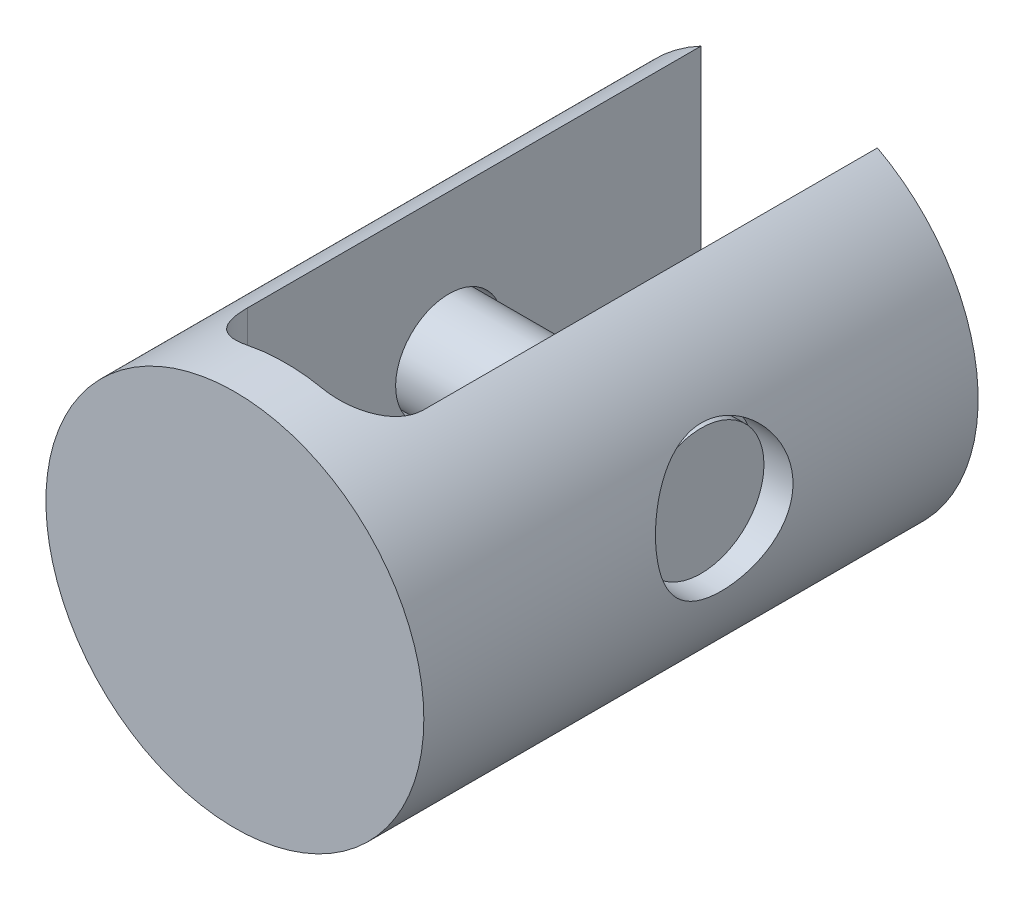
ISO-10303-21;
HEADER;
FILE_DESCRIPTION(('STEP AP214'),'2;1');
FILE_NAME('part.step','',(''),(''),'','','');
FILE_SCHEMA(('AUTOMOTIVE_DESIGN { 1 0 10303 214 1 1 1 1 }'));
ENDSEC;
DATA;
#1=APPLICATION_CONTEXT('core data for automotive mechanical design processes');
#2=APPLICATION_PROTOCOL_DEFINITION('international standard','automotive_design',2000,#1);
#3=PRODUCT_CONTEXT('',#1,'mechanical');
#4=PRODUCT('Part','Part','',(#3));
#5=PRODUCT_RELATED_PRODUCT_CATEGORY('part','',(#4));
#6=PRODUCT_DEFINITION_FORMATION('','',#4);
#7=PRODUCT_DEFINITION_CONTEXT('part definition',#1,'design');
#8=PRODUCT_DEFINITION('design','',#6,#7);
#9=PRODUCT_DEFINITION_SHAPE('','',#8);
#10=(LENGTH_UNIT() NAMED_UNIT(*) SI_UNIT(.MILLI.,.METRE.));
#11=(NAMED_UNIT(*) PLANE_ANGLE_UNIT() SI_UNIT($,.RADIAN.));
#12=(NAMED_UNIT(*) SI_UNIT($,.STERADIAN.) SOLID_ANGLE_UNIT());
#13=UNCERTAINTY_MEASURE_WITH_UNIT(LENGTH_MEASURE(1.E-05),#10,'distance_accuracy_value','');
#14=(GEOMETRIC_REPRESENTATION_CONTEXT(3) GLOBAL_UNCERTAINTY_ASSIGNED_CONTEXT((#13)) GLOBAL_UNIT_ASSIGNED_CONTEXT((#10,
#11,#12)) REPRESENTATION_CONTEXT('',''));
#15=CARTESIAN_POINT('',(0.,0.,0.));
#16=DIRECTION('',(0.,0.,1.));
#17=DIRECTION('',(1.,0.,0.));
#18=AXIS2_PLACEMENT_3D('',#15,#16,#17);
#19=CARTESIAN_POINT('',(19.05,3.175,0.));
#20=DIRECTION('',(-1.,0.,0.));
#21=DIRECTION('',(0.,0.,1.));
#22=AXIS2_PLACEMENT_3D('',#19,#20,#21);
#23=CYLINDRICAL_SURFACE('',#22,6.35);
#24=CARTESIAN_POINT('',(19.05,3.175,0.));
#25=DIRECTION('',(1.,0.,0.));
#26=DIRECTION('',(0.,0.,-1.));
#27=AXIS2_PLACEMENT_3D('',#24,#25,#26);
#28=CIRCLE('',#27,6.35);
#29=CARTESIAN_POINT('',(19.05,3.175,6.35));
#30=VERTEX_POINT('',#29);
#31=EDGE_CURVE('E11',#30,#30,#28,.T.);
#32=CARTESIAN_POINT('',(-19.05,3.175,0.));
#33=DIRECTION('',(1.,0.,0.));
#34=DIRECTION('',(0.,0.,-1.));
#35=AXIS2_PLACEMENT_3D('',#32,#33,#34);
#36=CIRCLE('',#35,6.35);
#37=CARTESIAN_POINT('',(-19.05,3.175,6.35));
#38=VERTEX_POINT('',#37);
#39=EDGE_CURVE('E55',#38,#38,#36,.T.);
#40=CARTESIAN_POINT('',(19.05,3.175,6.35));
#41=CARTESIAN_POINT('',(18.653125,3.175,6.35));
#42=CARTESIAN_POINT('',(18.25625,3.175,6.35));
#43=CARTESIAN_POINT('',(17.4625,3.175,6.35));
#44=CARTESIAN_POINT('',(17.065625,3.175,6.35));
#45=CARTESIAN_POINT('',(16.271875,3.175,6.35));
#46=CARTESIAN_POINT('',(15.875,3.175,6.35));
#47=CARTESIAN_POINT('',(15.08125,3.175,6.35));
#48=CARTESIAN_POINT('',(14.684375,3.175,6.35));
#49=CARTESIAN_POINT('',(13.890625,3.175,6.35));
#50=CARTESIAN_POINT('',(13.49375,3.175,6.35));
#51=CARTESIAN_POINT('',(12.7,3.175,6.35));
#52=CARTESIAN_POINT('',(12.303125,3.175,6.35));
#53=CARTESIAN_POINT('',(11.509375,3.175,6.35));
#54=CARTESIAN_POINT('',(11.1125,3.175,6.35));
#55=CARTESIAN_POINT('',(10.31875,3.175,6.35));
#56=CARTESIAN_POINT('',(9.921875,3.175,6.35));
#57=CARTESIAN_POINT('',(9.128125,3.175,6.35));
#58=CARTESIAN_POINT('',(8.73125,3.175,6.35));
#59=CARTESIAN_POINT('',(7.9375,3.175,6.35));
#60=CARTESIAN_POINT('',(7.540625,3.175,6.35));
#61=CARTESIAN_POINT('',(6.746875,3.175,6.35));
#62=CARTESIAN_POINT('',(6.35,3.175,6.35));
#63=CARTESIAN_POINT('',(5.55625,3.175,6.35));
#64=CARTESIAN_POINT('',(5.159375,3.175,6.35));
#65=CARTESIAN_POINT('',(4.365625,3.175,6.35));
#66=CARTESIAN_POINT('',(3.96875,3.175,6.35));
#67=CARTESIAN_POINT('',(3.175,3.175,6.35));
#68=CARTESIAN_POINT('',(2.778125,3.175,6.35));
#69=CARTESIAN_POINT('',(1.984375,3.175,6.35));
#70=CARTESIAN_POINT('',(1.5875,3.175,6.35));
#71=CARTESIAN_POINT('',(0.793749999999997,3.175,6.35));
#72=CARTESIAN_POINT('',(0.396874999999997,3.175,6.35));
#73=CARTESIAN_POINT('',(-0.396875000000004,3.175,6.35));
#74=CARTESIAN_POINT('',(-0.793750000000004,3.175,6.35));
#75=CARTESIAN_POINT('',(-1.5875,3.175,6.35));
#76=CARTESIAN_POINT('',(-1.984375,3.175,6.35));
#77=CARTESIAN_POINT('',(-2.77812500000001,3.175,6.35));
#78=CARTESIAN_POINT('',(-3.17500000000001,3.175,6.35));
#79=CARTESIAN_POINT('',(-3.96875000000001,3.175,6.35));
#80=CARTESIAN_POINT('',(-4.36562500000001,3.175,6.35));
#81=CARTESIAN_POINT('',(-5.15937500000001,3.175,6.35));
#82=CARTESIAN_POINT('',(-5.55625,3.175,6.35));
#83=CARTESIAN_POINT('',(-6.35,3.175,6.35));
#84=CARTESIAN_POINT('',(-6.746875,3.175,6.35));
#85=CARTESIAN_POINT('',(-7.540625,3.175,6.35));
#86=CARTESIAN_POINT('',(-7.93750000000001,3.175,6.35));
#87=CARTESIAN_POINT('',(-8.73125,3.175,6.35));
#88=CARTESIAN_POINT('',(-9.12812500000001,3.175,6.35));
#89=CARTESIAN_POINT('',(-9.92187500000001,3.175,6.35));
#90=CARTESIAN_POINT('',(-10.31875,3.175,6.35));
#91=CARTESIAN_POINT('',(-11.1125,3.175,6.35));
#92=CARTESIAN_POINT('',(-11.509375,3.175,6.35));
#93=CARTESIAN_POINT('',(-12.303125,3.175,6.35));
#94=CARTESIAN_POINT('',(-12.7,3.175,6.35));
#95=CARTESIAN_POINT('',(-13.49375,3.175,6.35));
#96=CARTESIAN_POINT('',(-13.890625,3.175,6.35));
#97=CARTESIAN_POINT('',(-14.684375,3.175,6.35));
#98=CARTESIAN_POINT('',(-15.08125,3.175,6.35));
#99=CARTESIAN_POINT('',(-15.875,3.175,6.35));
#100=CARTESIAN_POINT('',(-16.271875,3.175,6.35));
#101=CARTESIAN_POINT('',(-17.065625,3.175,6.35));
#102=CARTESIAN_POINT('',(-17.4625,3.175,6.35));
#103=CARTESIAN_POINT('',(-18.25625,3.175,6.35));
#104=CARTESIAN_POINT('',(-18.653125,3.175,6.35));
#105=CARTESIAN_POINT('',(-19.05,3.175,6.35));
#106=B_SPLINE_CURVE_WITH_KNOTS('',3,(#40,#41,#42,#43,#44,#45,#46,#47,#48,#49,#50,#51,#52,#53,
#54,#55,#56,#57,#58,#59,#60,#61,#62,#63,#64,#65,#66,#67,#68,#69,#70,#71,#72,#73,#74,#75,#76,#77,
#78,#79,#80,#81,#82,#83,#84,#85,#86,#87,#88,#89,#90,#91,#92,#93,#94,#95,#96,#97,#98,#99,#100,
#101,#102,#103,#104,#105),.UNSPECIFIED.,.F.,.F.,(4,2,2,2,2,2,2,2,2,2,2,2,2,2,2,2,2,2,2,2,2,2,2,
2,2,2,2,2,2,2,2,2,4),(0.,1.190625,2.38125,3.571875,4.7625,5.953125,7.14375,8.334375,9.525,
10.715625,11.90625,13.096875,14.2875,15.478125,16.66875,17.859375,19.05,20.240625,21.43125,
22.621875,23.8125,25.003125,26.19375,27.384375,28.575,29.765625,30.95625,32.146875,33.3375,
34.528125,35.71875,36.909375,38.1),.UNSPECIFIED.);
#107=EDGE_CURVE('BSEAM52',#30,#38,#106,.T.);
#108=ORIENTED_EDGE('',*,*,#31,.F.);
#109=ORIENTED_EDGE('',*,*,#39,.T.);
#110=ORIENTED_EDGE('',*,*,#107,.T.);
#111=ORIENTED_EDGE('',*,*,#107,.F.);
#112=EDGE_LOOP('',(#108,#110,#109,#111));
#113=FACE_BOUND('',#112,.T.);
#114=ADVANCED_FACE('F52',(#113),#23,.T.);
#115=CARTESIAN_POINT('',(20.6375,3.175,0.));
#116=DIRECTION('',(-1.,0.,0.));
#117=DIRECTION('',(0.,0.,1.));
#118=AXIS2_PLACEMENT_3D('',#115,#116,#117);
#119=CYLINDRICAL_SURFACE('',#118,7.9375);
#120=CARTESIAN_POINT('',(20.6375,3.175,0.));
#121=DIRECTION('',(1.,0.,0.));
#122=DIRECTION('',(0.,0.,-1.));
#123=AXIS2_PLACEMENT_3D('',#120,#121,#122);
#124=CIRCLE('',#123,7.9375);
#125=CARTESIAN_POINT('',(20.6375,3.175,-7.9375));
#126=VERTEX_POINT('',#125);
#127=EDGE_CURVE('E59',#126,#126,#124,.T.);
#128=ORIENTED_EDGE('',*,*,#127,.F.);
#129=EDGE_LOOP('',(#128));
#130=FACE_BOUND('',#129,.T.);
#131=CARTESIAN_POINT('',(19.05,3.175,0.));
#132=DIRECTION('',(1.,0.,0.));
#133=DIRECTION('',(0.,0.,-1.));
#134=AXIS2_PLACEMENT_3D('',#131,#132,#133);
#135=CIRCLE('',#134,7.9375);
#136=CARTESIAN_POINT('',(19.05,3.175,-7.9375));
#137=VERTEX_POINT('',#136);
#138=EDGE_CURVE('E63',#137,#137,#135,.T.);
#139=ORIENTED_EDGE('',*,*,#138,.T.);
#140=EDGE_LOOP('',(#139));
#141=FACE_BOUND('',#140,.T.);
#142=ADVANCED_FACE('F100',(#130,#141),#119,.T.);
#143=CARTESIAN_POINT('',(20.6375,3.175,0.));
#144=DIRECTION('',(1.,0.,0.));
#145=DIRECTION('',(0.,0.,-1.));
#146=AXIS2_PLACEMENT_3D('',#143,#144,#145);
#147=PLANE('',#146);
#148=ORIENTED_EDGE('',*,*,#127,.T.);
#149=EDGE_LOOP('',(#148));
#150=FACE_BOUND('',#149,.T.);
#151=ADVANCED_FACE('F96',(#150),#147,.T.);
#152=CARTESIAN_POINT('',(19.05,3.175,0.));
#153=DIRECTION('',(1.,0.,0.));
#154=DIRECTION('',(0.,0.,-1.));
#155=AXIS2_PLACEMENT_3D('',#152,#153,#154);
#156=PLANE('',#155);
#157=ORIENTED_EDGE('',*,*,#31,.T.);
#158=EDGE_LOOP('',(#157));
#159=FACE_BOUND('',#158,.T.);
#160=ORIENTED_EDGE('',*,*,#138,.F.);
#161=EDGE_LOOP('',(#160));
#162=FACE_BOUND('',#161,.T.);
#163=ADVANCED_FACE('F88',(#159,#162),#156,.F.);
#164=CARTESIAN_POINT('',(-20.6375,3.175,0.));
#165=DIRECTION('',(1.,0.,0.));
#166=DIRECTION('',(0.,0.,-1.));
#167=AXIS2_PLACEMENT_3D('',#164,#165,#166);
#168=CYLINDRICAL_SURFACE('',#167,7.9375);
#169=CARTESIAN_POINT('',(-20.6375,3.175,0.));
#170=DIRECTION('',(1.,0.,0.));
#171=DIRECTION('',(0.,0.,-1.));
#172=AXIS2_PLACEMENT_3D('',#169,#170,#171);
#173=CIRCLE('',#172,7.9375);
#174=CARTESIAN_POINT('',(-20.6375,3.175,-7.9375));
#175=VERTEX_POINT('',#174);
#176=EDGE_CURVE('E71',#175,#175,#173,.T.);
#177=ORIENTED_EDGE('',*,*,#176,.T.);
#178=EDGE_LOOP('',(#177));
#179=FACE_BOUND('',#178,.T.);
#180=CARTESIAN_POINT('',(-19.05,3.175,0.));
#181=DIRECTION('',(1.,0.,0.));
#182=DIRECTION('',(0.,0.,-1.));
#183=AXIS2_PLACEMENT_3D('',#180,#181,#182);
#184=CIRCLE('',#183,7.9375);
#185=CARTESIAN_POINT('',(-19.05,3.175,-7.9375));
#186=VERTEX_POINT('',#185);
#187=EDGE_CURVE('E68',#186,#186,#184,.T.);
#188=ORIENTED_EDGE('',*,*,#187,.F.);
#189=EDGE_LOOP('',(#188));
#190=FACE_BOUND('',#189,.T.);
#191=ADVANCED_FACE('F86',(#179,#190),#168,.T.);
#192=CARTESIAN_POINT('',(-20.6375,3.175,0.));
#193=DIRECTION('',(-1.,0.,0.));
#194=DIRECTION('',(0.,0.,-1.));
#195=AXIS2_PLACEMENT_3D('',#192,#193,#194);
#196=PLANE('',#195);
#197=ORIENTED_EDGE('',*,*,#176,.F.);
#198=EDGE_LOOP('',(#197));
#199=FACE_BOUND('',#198,.T.);
#200=ADVANCED_FACE('F82',(#199),#196,.T.);
#201=CARTESIAN_POINT('',(-19.05,3.175,0.));
#202=DIRECTION('',(-1.,0.,0.));
#203=DIRECTION('',(0.,0.,-1.));
#204=AXIS2_PLACEMENT_3D('',#201,#202,#203);
#205=PLANE('',#204);
#206=ORIENTED_EDGE('',*,*,#39,.F.);
#207=EDGE_LOOP('',(#206));
#208=FACE_BOUND('',#207,.T.);
#209=ORIENTED_EDGE('',*,*,#187,.T.);
#210=EDGE_LOOP('',(#209));
#211=FACE_BOUND('',#210,.T.);
#212=ADVANCED_FACE('F79',(#208,#211),#205,.F.);
#213=CLOSED_SHELL('',(#114,#142,#151,#163,#191,#200,#212));
#214=MANIFOLD_SOLID_BREP('B2',#213);
#215=CARTESIAN_POINT('',(-27.94,3.175,0.));
#216=DIRECTION('',(1.,0.,0.));
#217=DIRECTION('',(0.,0.,-1.));
#218=AXIS2_PLACEMENT_3D('',#215,#216,#217);
#219=CYLINDRICAL_SURFACE('',#218,6.731);
#220=CARTESIAN_POINT('',(-11.1125,3.175,0.));
#221=DIRECTION('',(-1.,0.,0.));
#222=DIRECTION('',(0.,-1.,0.));
#223=AXIS2_PLACEMENT_3D('',#220,#221,#222);
#224=CIRCLE('',#223,6.731);
#225=CARTESIAN_POINT('',(-11.1125,-3.556,0.));
#226=VERTEX_POINT('',#225);
#227=EDGE_CURVE('E271',#226,#226,#224,.T.);
#228=ORIENTED_EDGE('',*,*,#227,.F.);
#229=EDGE_LOOP('',(#228));
#230=FACE_BOUND('',#229,.T.);
#231=CARTESIAN_POINT('',(-18.653125,3.175,0.));
#232=DIRECTION('',(-1.,0.,0.));
#233=DIRECTION('',(0.,0.,1.));
#234=AXIS2_PLACEMENT_3D('',#231,#232,#233);
#235=CIRCLE('',#234,6.731);
#236=CARTESIAN_POINT('',(-18.653125,3.175,6.731));
#237=VERTEX_POINT('',#236);
#238=EDGE_CURVE('E387',#237,#237,#235,.F.);
#239=ORIENTED_EDGE('',*,*,#238,.F.);
#240=EDGE_LOOP('',(#239));
#241=FACE_BOUND('',#240,.T.);
#242=ADVANCED_FACE('F179',(#230,#241),#219,.F.);
#243=CARTESIAN_POINT('',(0.,0.,31.75));
#244=DIRECTION('',(0.,0.,-1.));
#245=DIRECTION('',(-1.,0.,0.));
#246=AXIS2_PLACEMENT_3D('',#243,#244,#245);
#247=CYLINDRICAL_SURFACE('',#246,23.8125);
#248=CARTESIAN_POINT('',(-23.8125,0.,7.96285948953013));
#249=CARTESIAN_POINT('',(-23.8125001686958,-0.220960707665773,7.8747568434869));
#250=CARTESIAN_POINT('',(-23.8094184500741,-0.4382485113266,7.77745076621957));
#251=CARTESIAN_POINT('',(-23.7977778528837,-0.863859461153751,7.56517836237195));
#252=CARTESIAN_POINT('',(-23.7892189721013,-1.072182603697,7.45021202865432));
#253=CARTESIAN_POINT('',(-23.767434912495,-1.47836565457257,7.20349964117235));
#254=CARTESIAN_POINT('',(-23.7542099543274,-1.67622605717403,7.07175438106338));
#255=CARTESIAN_POINT('',(-23.7239915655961,-2.06021682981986,6.79239704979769));
#256=CARTESIAN_POINT('',(-23.706996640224,-2.2463425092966,6.64477869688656));
#257=CARTESIAN_POINT('',(-23.6702456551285,-2.60520750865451,6.3350634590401));
#258=CARTESIAN_POINT('',(-23.6504949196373,-2.77797166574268,6.1729947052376));
#259=CARTESIAN_POINT('',(-23.6091983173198,-3.10947431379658,5.83516672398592));
#260=CARTESIAN_POINT('',(-23.5876516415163,-3.26820641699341,5.65940132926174));
#261=CARTESIAN_POINT('',(-23.5437811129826,-3.57055600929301,5.29539536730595));
#262=CARTESIAN_POINT('',(-23.5214572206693,-3.71417272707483,5.10715416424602));
#263=CARTESIAN_POINT('',(-23.4770399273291,-3.98530068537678,4.7195096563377));
#264=CARTESIAN_POINT('',(-23.4549464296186,-4.11281895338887,4.52011127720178));
#265=CARTESIAN_POINT('',(-23.4114685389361,-4.35357226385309,4.10691616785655));
#266=CARTESIAN_POINT('',(-23.3901099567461,-4.46643708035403,3.8929008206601));
#267=CARTESIAN_POINT('',(-23.3495777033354,-4.6737063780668,3.45600934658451));
#268=CARTESIAN_POINT('',(-23.3304032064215,-4.76811784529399,3.23313661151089));
#269=CARTESIAN_POINT('',(-23.2950741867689,-4.93783305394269,2.7799712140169));
#270=CARTESIAN_POINT('',(-23.2789199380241,-5.01313506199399,2.54967788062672));
#271=CARTESIAN_POINT('',(-23.2503478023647,-5.1440234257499,2.08332801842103));
#272=CARTESIAN_POINT('',(-23.2379298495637,-5.19961012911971,1.84727159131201));
#273=CARTESIAN_POINT('',(-23.2174937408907,-5.29011075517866,1.37372710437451));
#274=CARTESIAN_POINT('',(-23.2094288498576,-5.32524459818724,1.13628309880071));
#275=CARTESIAN_POINT('',(-23.1978445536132,-5.37548436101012,0.659174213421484));
#276=CARTESIAN_POINT('',(-23.1943251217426,-5.39059039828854,0.419509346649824));
#277=CARTESIAN_POINT('',(-23.191986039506,-5.40064501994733,-0.0602415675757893));
#278=CARTESIAN_POINT('',(-23.1931659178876,-5.39559562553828,-0.300327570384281));
#279=CARTESIAN_POINT('',(-23.2001727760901,-5.36538712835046,-0.779160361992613));
#280=CARTESIAN_POINT('',(-23.2059997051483,-5.34022824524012,-1.01790716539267));
#281=CARTESIAN_POINT('',(-23.2218823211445,-5.27072818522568,-1.48748810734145));
#282=CARTESIAN_POINT('',(-23.2318498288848,-5.22678647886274,-1.71838451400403));
#283=CARTESIAN_POINT('',(-23.255587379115,-5.12013609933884,-2.17568808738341));
#284=CARTESIAN_POINT('',(-23.2693587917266,-5.05742066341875,-2.40209360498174));
#285=CARTESIAN_POINT('',(-23.3001281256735,-4.91371333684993,-2.8487739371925));
#286=CARTESIAN_POINT('',(-23.3171257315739,-4.83272323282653,-3.0690493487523));
#287=CARTESIAN_POINT('',(-23.3536441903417,-4.65304821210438,-3.50205160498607));
#288=CARTESIAN_POINT('',(-23.3731651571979,-4.5543624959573,-3.71477810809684));
#289=CARTESIAN_POINT('',(-23.4142224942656,-4.33838647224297,-4.13440280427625));
#290=CARTESIAN_POINT('',(-23.4357845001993,-4.22084152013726,-4.34116743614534));
#291=CARTESIAN_POINT('',(-23.4797417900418,-3.96903136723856,-4.74415707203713));
#292=CARTESIAN_POINT('',(-23.5021370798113,-3.834766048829,-4.94038200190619));
#293=CARTESIAN_POINT('',(-23.5467771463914,-3.55037411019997,-5.32104820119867));
#294=CARTESIAN_POINT('',(-23.5690218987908,-3.40024498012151,-5.50548759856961));
#295=CARTESIAN_POINT('',(-23.6123381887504,-3.08511432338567,-5.86133150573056));
#296=CARTESIAN_POINT('',(-23.63340975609,-2.92011317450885,-6.03273634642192));
#297=CARTESIAN_POINT('',(-23.6737261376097,-2.57311251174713,-6.3644024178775));
#298=CARTESIAN_POINT('',(-23.692929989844,-2.39085518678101,-6.52439912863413));
#299=CARTESIAN_POINT('',(-23.7279927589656,-2.01331450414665,-6.82846046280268));
#300=CARTESIAN_POINT('',(-23.7438529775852,-1.81803625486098,-6.97253127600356));
#301=CARTESIAN_POINT('',(-23.7712318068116,-1.41574528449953,-7.2437325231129));
#302=CARTESIAN_POINT('',(-23.7827502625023,-1.20873214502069,-7.37086235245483));
#303=CARTESIAN_POINT('',(-23.8005209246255,-0.784488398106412,-7.6071781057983));
#304=CARTESIAN_POINT('',(-23.8067732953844,-0.567258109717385,-7.71636458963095));
#305=CARTESIAN_POINT('',(-23.8131273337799,-0.129677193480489,-7.9134710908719));
#306=CARTESIAN_POINT('',(-23.8133763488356,0.0904656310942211,-8.00184770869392));
#307=CARTESIAN_POINT('',(-23.8074867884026,0.537243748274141,-8.16003383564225));
#308=CARTESIAN_POINT('',(-23.8013483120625,0.763878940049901,-8.22984363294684));
#309=CARTESIAN_POINT('',(-23.7822369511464,1.221829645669,-8.35038511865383));
#310=CARTESIAN_POINT('',(-23.7692656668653,1.45314405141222,-8.40112126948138));
#311=CARTESIAN_POINT('',(-23.7362227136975,1.9186801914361,-8.48323522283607));
#312=CARTESIAN_POINT('',(-23.7161512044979,2.15290186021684,-8.51461346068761));
#313=CARTESIAN_POINT('',(-23.669673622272,2.61409923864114,-8.55715295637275));
#314=CARTESIAN_POINT('',(-23.6435167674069,2.84103815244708,-8.56899015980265));
#315=CARTESIAN_POINT('',(-23.5846370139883,3.29427890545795,-8.57466569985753));
#316=CARTESIAN_POINT('',(-23.5519143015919,3.52058076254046,-8.56850454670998));
#317=CARTESIAN_POINT('',(-23.4801751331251,3.97096036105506,-8.5384504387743));
#318=CARTESIAN_POINT('',(-23.441159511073,4.19503839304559,-8.51455983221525));
#319=CARTESIAN_POINT('',(-23.3572313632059,4.63962269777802,-8.44944571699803));
#320=CARTESIAN_POINT('',(-23.3123165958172,4.86012757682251,-8.40821560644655));
#321=CARTESIAN_POINT('',(-23.2163150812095,5.29994498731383,-8.30807547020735));
#322=CARTESIAN_POINT('',(-23.1651342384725,5.51916943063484,-8.24886923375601));
#323=CARTESIAN_POINT('',(-23.0579174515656,5.9512323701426,-8.11366450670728));
#324=CARTESIAN_POINT('',(-23.001879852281,6.16406865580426,-8.0376602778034));
#325=CARTESIAN_POINT('',(-22.8857506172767,6.5821462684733,-7.86955379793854));
#326=CARTESIAN_POINT('',(-22.8256587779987,6.78738721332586,-7.77745073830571));
#327=CARTESIAN_POINT('',(-22.702290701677,7.18925190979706,-7.57785455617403));
#328=CARTESIAN_POINT('',(-22.6390142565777,7.38587509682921,-7.4703604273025));
#329=CARTESIAN_POINT('',(-22.5055891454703,7.78335754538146,-7.23244263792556));
#330=CARTESIAN_POINT('',(-22.4352732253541,7.98350768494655,-7.10092690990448));
#331=CARTESIAN_POINT('',(-22.2933104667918,8.37174914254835,-6.82192699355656));
#332=CARTESIAN_POINT('',(-22.2216639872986,8.55984365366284,-6.67444706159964));
#333=CARTESIAN_POINT('',(-22.0782728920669,8.92318290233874,-6.36421639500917));
#334=CARTESIAN_POINT('',(-22.0065282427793,9.09841911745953,-6.2014556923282));
#335=CARTESIAN_POINT('',(-21.8643514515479,9.43497074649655,-5.86154710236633));
#336=CARTESIAN_POINT('',(-21.7939195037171,9.5962841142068,-5.68439710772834));
#337=CARTESIAN_POINT('',(-21.6523067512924,9.91181991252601,-5.30721202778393));
#338=CARTESIAN_POINT('',(-21.5812697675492,10.0652654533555,-5.10647146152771));
#339=CARTESIAN_POINT('',(-21.4440235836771,10.3544494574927,-4.69118883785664));
#340=CARTESIAN_POINT('',(-21.3778123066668,10.4901955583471,-4.47665279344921));
#341=CARTESIAN_POINT('',(-21.2519889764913,10.7428133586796,-4.0349316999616));
#342=CARTESIAN_POINT('',(-21.1923758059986,10.8596882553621,-3.80774880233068));
#343=CARTESIAN_POINT('',(-21.0815394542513,11.0733168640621,-3.34214465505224));
#344=CARTESIAN_POINT('',(-21.03031541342,11.1700726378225,-3.1037245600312));
#345=CARTESIAN_POINT('',(-20.9408385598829,11.3368795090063,-2.6324918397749));
#346=CARTESIAN_POINT('',(-20.9019779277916,11.4082154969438,-2.40024988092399));
#347=CARTESIAN_POINT('',(-20.8344051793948,11.5311600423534,-1.92914317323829));
#348=CARTESIAN_POINT('',(-20.8056926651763,11.5827693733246,-1.69027868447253));
#349=CARTESIAN_POINT('',(-20.7594454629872,11.6654545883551,-1.20817814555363));
#350=CARTESIAN_POINT('',(-20.7419002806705,11.6965497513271,-0.964946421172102));
#351=CARTESIAN_POINT('',(-20.7185981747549,11.7377774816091,-0.476160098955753));
#352=CARTESIAN_POINT('',(-20.7128399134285,11.7479124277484,-0.230605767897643));
#353=CARTESIAN_POINT('',(-20.7132922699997,11.7471126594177,0.230979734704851));
#354=CARTESIAN_POINT('',(-20.718150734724,11.7385582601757,0.447021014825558));
#355=CARTESIAN_POINT('',(-20.7370116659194,11.7052071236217,0.877444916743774));
#356=CARTESIAN_POINT('',(-20.7510140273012,11.6804105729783,1.0918275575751));
#357=CARTESIAN_POINT('',(-20.7877610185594,11.6148849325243,1.51738405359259));
#358=CARTESIAN_POINT('',(-20.8105060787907,11.5741550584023,1.72855775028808));
#359=CARTESIAN_POINT('',(-20.8641102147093,11.4772436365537,2.14627213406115));
#360=CARTESIAN_POINT('',(-20.8949695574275,11.4210615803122,2.35281266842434));
#361=CARTESIAN_POINT('',(-20.9636511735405,11.2944946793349,2.75792095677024));
#362=CARTESIAN_POINT('',(-21.001398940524,11.2242611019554,2.95654867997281));
#363=CARTESIAN_POINT('',(-21.0831742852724,11.0698933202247,3.34701894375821));
#364=CARTESIAN_POINT('',(-21.1272038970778,10.9857546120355,3.5388592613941));
#365=CARTESIAN_POINT('',(-21.2672807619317,10.7135254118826,4.10273773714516));
#366=CARTESIAN_POINT('',(-21.3713584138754,10.5055462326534,4.4633727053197));
#367=CARTESIAN_POINT('',(-21.6050174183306,10.0169402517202,5.18513336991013));
#368=CARTESIAN_POINT('',(-21.7361400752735,9.73088536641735,5.54208317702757));
#369=CARTESIAN_POINT('',(-21.9374642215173,9.26346469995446,6.03905855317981));
#370=CARTESIAN_POINT('',(-22.0053890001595,9.1011560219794,6.19839525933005));
#371=CARTESIAN_POINT('',(-22.1416529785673,8.76443407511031,6.50366007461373));
#372=CARTESIAN_POINT('',(-22.2099922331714,8.59001917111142,6.64958636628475));
#373=CARTESIAN_POINT('',(-22.3523775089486,8.21284257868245,6.94045320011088));
#374=CARTESIAN_POINT('',(-22.4263484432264,8.00896234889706,7.08398126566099));
#375=CARTESIAN_POINT('',(-22.5719378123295,7.58894966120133,7.35302494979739));
#376=CARTESIAN_POINT('',(-22.6435570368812,7.37282138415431,7.47854666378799));
#377=CARTESIAN_POINT('',(-22.7831518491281,6.92944224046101,7.71067741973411));
#378=CARTESIAN_POINT('',(-22.8511267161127,6.7021891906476,7.81728273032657));
#379=CARTESIAN_POINT('',(-22.9821826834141,6.23799529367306,8.0105564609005));
#380=CARTESIAN_POINT('',(-23.0452639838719,6.00105484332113,8.09722569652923));
#381=CARTESIAN_POINT('',(-23.1645929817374,5.52238891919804,8.248615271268));
#382=CARTESIAN_POINT('',(-23.2209231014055,5.28077489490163,8.31362250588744));
#383=CARTESIAN_POINT('',(-23.3268237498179,4.79135934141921,8.42246848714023));
#384=CARTESIAN_POINT('',(-23.3763942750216,4.54355780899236,8.46630722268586));
#385=CARTESIAN_POINT('',(-23.4680054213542,4.04380745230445,8.5320815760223));
#386=CARTESIAN_POINT('',(-23.5100496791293,3.791860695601,8.55402779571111));
#387=CARTESIAN_POINT('',(-23.5860989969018,3.28580875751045,8.57552334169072));
#388=CARTESIAN_POINT('',(-23.6201046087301,3.03170372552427,8.57507420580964));
#389=CARTESIAN_POINT('',(-23.6777300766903,2.5410662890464,8.5523086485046));
#390=CARTESIAN_POINT('',(-23.7019035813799,2.30452789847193,8.5314990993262));
#391=CARTESIAN_POINT('',(-23.7429939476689,1.83338503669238,8.47019775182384));
#392=CARTESIAN_POINT('',(-23.7599112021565,1.59878046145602,8.42970701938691));
#393=CARTESIAN_POINT('',(-23.7866544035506,1.13338427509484,8.32923963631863));
#394=CARTESIAN_POINT('',(-23.7964806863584,0.902592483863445,8.26926390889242));
#395=CARTESIAN_POINT('',(-23.8094034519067,0.446637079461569,8.13022754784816));
#396=CARTESIAN_POINT('',(-23.8124998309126,0.221473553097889,8.05116662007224));
#397=CARTESIAN_POINT('',(-23.8125,0.,7.96285948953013));
#398=B_SPLINE_CURVE_WITH_KNOTS('',3,(#248,#249,#250,#251,#252,#253,#254,#255,#256,#257,#258,
#259,#260,#261,#262,#263,#264,#265,#266,#267,#268,#269,#270,#271,#272,#273,#274,#275,#276,#277,
#278,#279,#280,#281,#282,#283,#284,#285,#286,#287,#288,#289,#290,#291,#292,#293,#294,#295,#296,
#297,#298,#299,#300,#301,#302,#303,#304,#305,#306,#307,#308,#309,#310,#311,#312,#313,#314,#315,
#316,#317,#318,#319,#320,#321,#322,#323,#324,#325,#326,#327,#328,#329,#330,#331,#332,#333,#334,
#335,#336,#337,#338,#339,#340,#341,#342,#343,#344,#345,#346,#347,#348,#349,#350,#351,#352,#353,
#354,#355,#356,#357,#358,#359,#360,#361,#362,#363,#364,#365,#366,#367,#368,#369,#370,#371,#372,
#373,#374,#375,#376,#377,#378,#379,#380,#381,#382,#383,#384,#385,#386,#387,#388,#389,#390,#391,
#392,#393,#394,#395,#396,#397),.UNSPECIFIED.,.T.,.F.,(4,2,2,2,2,2,2,2,2,2,2,2,2,2,2,2,2,2,2,2,2,
2,2,2,2,2,2,2,2,2,2,2,2,2,2,2,2,2,2,2,2,2,2,2,2,2,2,2,2,2,2,2,2,2,2,2,2,2,2,2,2,2,2,2,2,2,2,2,2,
2,2,2,2,2,4),(0.,0.713406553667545,1.4268133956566,2.14018650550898,2.85384297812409,
3.56613927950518,4.27875818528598,4.99141343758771,5.70375650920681,6.43156579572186,
7.15909901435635,7.88669820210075,8.61428455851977,9.33389567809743,10.0535025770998,
10.7730373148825,11.492564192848,12.1974952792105,12.9026806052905,13.607797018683,
14.3129452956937,15.0285708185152,15.7442013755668,16.4599453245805,17.1756710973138,
17.9046255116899,18.6332956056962,19.3619916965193,20.0906650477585,20.8014350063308,
21.5121939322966,22.2227864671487,22.9333630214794,23.6188014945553,24.3042205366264,
24.9895488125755,25.6751382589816,26.3727018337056,27.0705040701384,27.7683413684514,
28.4662243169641,29.2142045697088,29.9619858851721,30.710258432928,31.4586407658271,
32.2450529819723,33.0311247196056,33.8170631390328,34.6029209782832,35.3399952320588,
36.0770405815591,36.8133922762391,37.5496603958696,38.197659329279,38.845650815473,
39.4936742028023,40.141718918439,40.7831302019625,41.4247496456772,42.7072331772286,
44.1285962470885,44.8401569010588,45.5518138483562,46.3311239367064,47.1101695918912,
47.8893687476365,48.6685360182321,49.4369306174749,50.2053256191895,50.9733483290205,
51.741318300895,52.456442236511,53.1715274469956,53.8865787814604,54.6016411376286),.UNSPECIFIED.);
#399=CARTESIAN_POINT('',(-23.8125,0.,7.96285948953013));
#400=VERTEX_POINT('',#399);
#401=EDGE_CURVE('E184',#400,#400,#398,.T.);
#402=ORIENTED_EDGE('',*,*,#401,.T.);
#403=EDGE_LOOP('',(#402));
#404=FACE_BOUND('',#403,.T.);
#405=CARTESIAN_POINT('',(0.,0.,38.1));
#406=DIRECTION('',(0.,0.,1.));
#407=DIRECTION('',(1.,0.,0.));
#408=AXIS2_PLACEMENT_3D('',#405,#406,#407);
#409=CIRCLE('',#408,23.8125);
#410=CARTESIAN_POINT('',(23.8125,0.,38.1));
#411=VERTEX_POINT('',#410);
#412=EDGE_CURVE('E286',#411,#411,#409,.T.);
#413=ORIENTED_EDGE('',*,*,#412,.F.);
#414=EDGE_LOOP('',(#413));
#415=FACE_BOUND('',#414,.T.);
#416=DIRECTION('',(0.,0.,-1.));
#417=VECTOR('',#416,1.);
#418=CARTESIAN_POINT('',(11.1125,21.0605674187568,31.75));
#419=LINE('',#418,#417);
#420=CARTESIAN_POINT('',(11.1125,21.0605674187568,-31.75));
#421=VERTEX_POINT('',#420);
#422=CARTESIAN_POINT('',(11.1125,21.0605674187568,25.4));
#423=VERTEX_POINT('',#422);
#424=EDGE_CURVE('E266',#421,#423,#419,.F.);
#425=ORIENTED_EDGE('',*,*,#424,.T.);
#426=CARTESIAN_POINT('',(11.1125,21.0605674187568,25.4));
#427=CARTESIAN_POINT('',(11.1125290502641,21.0605360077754,25.5662880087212));
#428=CARTESIAN_POINT('',(11.1059694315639,21.0640128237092,25.7325601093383));
#429=CARTESIAN_POINT('',(11.0798914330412,21.077750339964,26.0637341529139));
#430=CARTESIAN_POINT('',(11.0603785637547,21.0880081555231,26.2286366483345));
#431=CARTESIAN_POINT('',(11.0087327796,21.1150124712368,26.5551150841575));
#432=CARTESIAN_POINT('',(10.9766590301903,21.1317285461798,26.7167029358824));
#433=CARTESIAN_POINT('',(10.9002776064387,21.1712296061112,27.0362043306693));
#434=CARTESIAN_POINT('',(10.8559690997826,21.1940150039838,27.1941176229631));
#435=CARTESIAN_POINT('',(10.7556728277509,21.2450891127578,27.5049959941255));
#436=CARTESIAN_POINT('',(10.6997034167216,21.2733691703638,27.6579684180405));
#437=CARTESIAN_POINT('',(10.5765968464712,21.3348421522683,27.9583519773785));
#438=CARTESIAN_POINT('',(10.5094554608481,21.3680369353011,28.1057609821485));
#439=CARTESIAN_POINT('',(10.2920386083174,21.4740565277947,28.5386047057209));
#440=CARTESIAN_POINT('',(10.1257765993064,21.5533133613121,28.8146372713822));
#441=CARTESIAN_POINT('',(9.74425451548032,21.728584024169,29.352231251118));
#442=CARTESIAN_POINT('',(9.52659170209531,21.8253330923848,29.6118275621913));
#443=CARTESIAN_POINT('',(9.05423858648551,22.0254750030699,30.0922129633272));
#444=CARTESIAN_POINT('',(8.79953152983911,22.1288708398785,30.3129843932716));
#445=CARTESIAN_POINT('',(8.38161143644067,22.2892105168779,30.6209447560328));
#446=CARTESIAN_POINT('',(8.22926579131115,22.3459637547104,30.7233203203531));
#447=CARTESIAN_POINT('',(7.91612306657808,22.4588021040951,30.9145969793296));
#448=CARTESIAN_POINT('',(7.75532874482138,22.5148874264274,31.0035024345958));
#449=CARTESIAN_POINT('',(7.42627734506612,22.6255541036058,31.1671970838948));
#450=CARTESIAN_POINT('',(7.2580220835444,22.6801358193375,31.2419896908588));
#451=CARTESIAN_POINT('',(6.91509717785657,22.7870316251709,31.3768506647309));
#452=CARTESIAN_POINT('',(6.74043070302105,22.8393468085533,31.436926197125));
#453=CARTESIAN_POINT('',(6.41838989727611,22.9316834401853,31.5321535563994));
#454=CARTESIAN_POINT('',(6.27190525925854,22.9721961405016,31.5698572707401));
#455=CARTESIAN_POINT('',(5.97604860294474,23.0509312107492,31.6348000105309));
#456=CARTESIAN_POINT('',(5.82667710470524,23.0891539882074,31.6620409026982));
#457=CARTESIAN_POINT('',(5.52563339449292,23.1630424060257,31.7058123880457));
#458=CARTESIAN_POINT('',(5.37395966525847,23.1987062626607,31.7223355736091));
#459=CARTESIAN_POINT('',(5.0691332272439,23.2672214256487,31.744436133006));
#460=CARTESIAN_POINT('',(4.91598002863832,23.3000717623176,31.7500097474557));
#461=CARTESIAN_POINT('',(4.7625,23.3313898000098,31.75));
#462=B_SPLINE_CURVE_WITH_KNOTS('',3,(#426,#427,#428,#429,#430,#431,#432,#433,#434,#435,#436,
#437,#438,#439,#440,#441,#442,#443,#444,#445,#446,#447,#448,#449,#450,#451,#452,#453,#454,#455,
#456,#457,#458,#459,#460,#461),.UNSPECIFIED.,.F.,.F.,(4,2,2,2,2,2,2,2,2,2,2,2,2,2,2,2,2,4),(0.,
0.498673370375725,0.99713473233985,1.49327589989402,1.98945082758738,2.48485059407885,
2.98043820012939,3.97167302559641,5.02450316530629,6.07781096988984,6.65362263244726,
7.22924749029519,7.80473296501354,8.37993768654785,8.84933679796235,9.31865212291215,
9.7882914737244,10.2580920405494),.UNSPECIFIED.);
#463=CARTESIAN_POINT('',(4.7625,23.3313898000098,31.75));
#464=VERTEX_POINT('',#463);
#465=EDGE_CURVE('E50',#423,#464,#462,.T.);
#466=ORIENTED_EDGE('',*,*,#465,.T.);
#467=CARTESIAN_POINT('',(0.,0.,31.75));
#468=DIRECTION('',(0.,0.,1.));
#469=DIRECTION('',(1.,0.,0.));
#470=AXIS2_PLACEMENT_3D('',#467,#468,#469);
#471=CIRCLE('',#470,23.8125);
#472=CARTESIAN_POINT('',(-4.76250000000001,23.3313898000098,31.75));
#473=VERTEX_POINT('',#472);
#474=EDGE_CURVE('E422',#464,#473,#471,.T.);
#475=ORIENTED_EDGE('',*,*,#474,.T.);
#476=CARTESIAN_POINT('',(-4.76250000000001,23.3313898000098,31.75));
#477=CARTESIAN_POINT('',(-4.94627776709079,23.2938986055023,31.7500195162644));
#478=CARTESIAN_POINT('',(-5.12957665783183,23.2541996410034,31.7420231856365));
#479=CARTESIAN_POINT('',(-5.49383879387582,23.1708331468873,31.7103870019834));
#480=CARTESIAN_POINT('',(-5.67480289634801,23.1271671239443,31.6867530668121));
#481=CARTESIAN_POINT('',(-6.03267955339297,23.036405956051,31.6243128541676));
#482=CARTESIAN_POINT('',(-6.20960164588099,22.9893202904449,31.5855473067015));
#483=CARTESIAN_POINT('',(-6.55873955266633,22.8921584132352,31.4933263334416));
#484=CARTESIAN_POINT('',(-6.73095499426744,22.842081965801,31.4398697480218));
#485=CARTESIAN_POINT('',(-7.06938267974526,22.7396172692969,31.3188713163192));
#486=CARTESIAN_POINT('',(-7.23560252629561,22.6872321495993,31.2513481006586));
#487=CARTESIAN_POINT('',(-7.5613242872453,22.5807651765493,31.1027328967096));
#488=CARTESIAN_POINT('',(-7.72082372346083,22.5266827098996,31.0216359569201));
#489=CARTESIAN_POINT('',(-8.18794414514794,22.3629442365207,30.7587708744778));
#490=CARTESIAN_POINT('',(-8.48426640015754,22.2517727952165,30.5573999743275));
#491=CARTESIAN_POINT('',(-9.05042666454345,22.0277406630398,30.0983095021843));
#492=CARTESIAN_POINT('',(-9.3187748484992,21.9149840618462,29.8386935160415));
#493=CARTESIAN_POINT('',(-9.68536464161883,21.754236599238,29.4153300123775));
#494=CARTESIAN_POINT('',(-9.80163670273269,21.7020206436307,29.2684451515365));
#495=CARTESIAN_POINT('',(-10.0212785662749,21.6014740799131,28.9641143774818));
#496=CARTESIAN_POINT('',(-10.1246542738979,21.5531416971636,28.8066733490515));
#497=CARTESIAN_POINT('',(-10.3157704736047,21.4623167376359,28.4851302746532));
#498=CARTESIAN_POINT('',(-10.4037637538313,21.4197330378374,28.3212041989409));
#499=CARTESIAN_POINT('',(-10.5654423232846,21.3404472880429,27.9851691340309));
#500=CARTESIAN_POINT('',(-10.639135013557,21.3037421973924,27.8130644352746));
#501=CARTESIAN_POINT('',(-10.7712659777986,21.2372422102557,27.4621163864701));
#502=CARTESIAN_POINT('',(-10.8297287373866,21.2074362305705,27.2832843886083));
#503=CARTESIAN_POINT('',(-10.9307287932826,21.1555560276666,26.920181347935));
#504=CARTESIAN_POINT('',(-10.9732741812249,21.1334778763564,26.7359131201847));
#505=CARTESIAN_POINT('',(-11.0423411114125,21.0974741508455,26.3607228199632));
#506=CARTESIAN_POINT('',(-11.0686168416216,21.0836737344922,26.1697426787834));
#507=CARTESIAN_POINT('',(-11.0949270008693,21.0698323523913,25.8818415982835));
#508=CARTESIAN_POINT('',(-11.101513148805,21.0663617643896,25.7856336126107));
#509=CARTESIAN_POINT('',(-11.1103002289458,21.0617282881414,25.5929563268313));
#510=CARTESIAN_POINT('',(-11.1125008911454,21.0605655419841,25.4964870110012));
#511=CARTESIAN_POINT('',(-11.1125,21.0605674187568,25.4));
#512=B_SPLINE_CURVE_WITH_KNOTS('',3,(#476,#477,#478,#479,#480,#481,#482,#483,#484,#485,#486,
#487,#488,#489,#490,#491,#492,#493,#494,#495,#496,#497,#498,#499,#500,#501,#502,#503,#504,#505,
#506,#507,#508,#509,#510,#511),.UNSPECIFIED.,.F.,.F.,(4,2,2,2,2,2,2,2,2,2,2,2,2,2,2,2,2,4),(0.,
0.562464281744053,1.1247158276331,1.68546427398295,2.2462569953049,2.80631164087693,
3.36657103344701,4.48683017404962,5.65092011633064,6.23372729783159,6.81626662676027,
7.38808235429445,7.95960135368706,8.53019575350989,9.10049969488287,9.67922235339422,
9.96859849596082,10.2579924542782),.UNSPECIFIED.);
#513=CARTESIAN_POINT('',(-11.1125,21.0605674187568,25.4));
#514=VERTEX_POINT('',#513);
#515=EDGE_CURVE('E194',#473,#514,#512,.T.);
#516=ORIENTED_EDGE('',*,*,#515,.T.);
#517=DIRECTION('',(0.,0.,-1.));
#518=VECTOR('',#517,1.);
#519=CARTESIAN_POINT('',(-11.1125,21.0605674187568,31.75));
#520=LINE('',#519,#518);
#521=CARTESIAN_POINT('',(-11.1125,21.0605674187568,-31.75));
#522=VERTEX_POINT('',#521);
#523=EDGE_CURVE('E270',#514,#522,#520,.T.);
#524=ORIENTED_EDGE('',*,*,#523,.T.);
#525=CARTESIAN_POINT('',(0.,0.,-31.75));
#526=DIRECTION('',(0.,0.,1.));
#527=DIRECTION('',(1.,0.,0.));
#528=AXIS2_PLACEMENT_3D('',#525,#526,#527);
#529=CIRCLE('',#528,23.8125);
#530=EDGE_CURVE('E258',#522,#421,#529,.T.);
#531=ORIENTED_EDGE('',*,*,#530,.T.);
#532=EDGE_LOOP('',(#425,#466,#475,#516,#524,#531));
#533=FACE_BOUND('',#532,.T.);
#534=CARTESIAN_POINT('',(23.5998841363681,3.175,8.5725));
#535=CARTESIAN_POINT('',(23.630509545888,2.94737117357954,8.57250186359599));
#536=CARTESIAN_POINT('',(23.6578292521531,2.71932142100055,8.56342803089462));
#537=CARTESIAN_POINT('',(23.7057363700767,2.26397834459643,8.52701243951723));
#538=CARTESIAN_POINT('',(23.7263243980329,2.03668495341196,8.49967235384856));
#539=CARTESIAN_POINT('',(23.7607976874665,1.58462158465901,8.42679381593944));
#540=CARTESIAN_POINT('',(23.7746857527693,1.35985059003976,8.38126299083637));
#541=CARTESIAN_POINT('',(23.7959824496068,0.914385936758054,8.2722404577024));
#542=CARTESIAN_POINT('',(23.8033908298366,0.693692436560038,8.2087480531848));
#543=CARTESIAN_POINT('',(23.812096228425,0.258156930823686,8.06426625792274));
#544=CARTESIAN_POINT('',(23.8133974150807,0.0433110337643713,7.98328884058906));
#545=CARTESIAN_POINT('',(23.8104178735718,-0.379231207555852,7.80434861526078));
#546=CARTESIAN_POINT('',(23.8061351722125,-0.586924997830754,7.70637981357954));
#547=CARTESIAN_POINT('',(23.7926304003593,-0.993625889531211,7.49419213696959));
#548=CARTESIAN_POINT('',(23.7834090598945,-1.19263427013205,7.37997566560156));
#549=CARTESIAN_POINT('',(23.7607694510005,-1.58075981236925,7.13603981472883));
#550=CARTESIAN_POINT('',(23.7473495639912,-1.76987312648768,7.00631446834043));
#551=CARTESIAN_POINT('',(23.7169204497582,-2.13956470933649,6.73031434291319));
#552=CARTESIAN_POINT('',(23.6998624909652,-2.31998160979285,6.58382884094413));
#553=CARTESIAN_POINT('',(23.6631824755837,-2.66826422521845,6.27677792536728));
#554=CARTESIAN_POINT('',(23.6435592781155,-2.83612430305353,6.11620625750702));
#555=CARTESIAN_POINT('',(23.6027013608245,-3.15816303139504,5.78209594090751));
#556=CARTESIAN_POINT('',(23.5814667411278,-3.31234253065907,5.60855809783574));
#557=CARTESIAN_POINT('',(23.5383369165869,-3.60609141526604,5.24960406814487));
#558=CARTESIAN_POINT('',(23.5164416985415,-3.74566050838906,5.06418764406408));
#559=CARTESIAN_POINT('',(23.4721059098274,-4.01430370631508,4.67542277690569));
#560=CARTESIAN_POINT('',(23.4496759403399,-4.1427829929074,4.47166167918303));
#561=CARTESIAN_POINT('',(23.4061250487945,-4.3821532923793,4.05402278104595));
#562=CARTESIAN_POINT('',(23.3850036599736,-4.49305059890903,3.8401486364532));
#563=CARTESIAN_POINT('',(23.3449832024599,-4.69656053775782,3.40357352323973));
#564=CARTESIAN_POINT('',(23.3260849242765,-4.78916667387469,3.1808694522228));
#565=CARTESIAN_POINT('',(23.2913543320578,-4.95531803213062,2.72832567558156));
#566=CARTESIAN_POINT('',(23.2755208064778,-5.02887079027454,2.4984888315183));
#567=CARTESIAN_POINT('',(23.247620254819,-5.15631309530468,2.03347751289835));
#568=CARTESIAN_POINT('',(23.235549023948,-5.21022460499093,1.79830931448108));
#569=CARTESIAN_POINT('',(23.2156795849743,-5.29805716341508,1.32408733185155));
#570=CARTESIAN_POINT('',(23.207881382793,-5.33197818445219,1.0850335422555));
#571=CARTESIAN_POINT('',(23.1969033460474,-5.3795380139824,0.604845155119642));
#572=CARTESIAN_POINT('',(23.1937228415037,-5.39317976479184,0.363710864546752));
#573=CARTESIAN_POINT('',(23.1921192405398,-5.40007180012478,-0.118862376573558));
#574=CARTESIAN_POINT('',(23.1936960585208,-5.39332245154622,-0.360301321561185));
#575=CARTESIAN_POINT('',(23.2014427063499,-5.35989680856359,-0.83592145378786));
#576=CARTESIAN_POINT('',(23.2075020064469,-5.33369999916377,-1.07013832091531));
#577=CARTESIAN_POINT('',(23.2238331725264,-5.26213590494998,-1.53556130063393));
#578=CARTESIAN_POINT('',(23.2341065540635,-5.21676172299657,-1.76676629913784));
#579=CARTESIAN_POINT('',(23.2584330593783,-5.10720966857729,-2.22443690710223));
#580=CARTESIAN_POINT('',(23.2724856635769,-5.04303438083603,-2.45090316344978));
#581=CARTESIAN_POINT('',(23.303784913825,-4.89636419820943,-2.89760307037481));
#582=CARTESIAN_POINT('',(23.3210316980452,-4.81386851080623,-3.11783645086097));
#583=CARTESIAN_POINT('',(23.3581247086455,-4.63054690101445,-3.55205629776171));
#584=CARTESIAN_POINT('',(23.3779875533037,-4.52960204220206,-3.76599111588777));
#585=CARTESIAN_POINT('',(23.41938266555,-4.31046388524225,-4.18466433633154));
#586=CARTESIAN_POINT('',(23.4409149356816,-4.19227056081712,-4.38940272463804));
#587=CARTESIAN_POINT('',(23.4847334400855,-3.93940513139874,-4.78840170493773));
#588=CARTESIAN_POINT('',(23.5070198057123,-3.80473014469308,-4.98266045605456));
#589=CARTESIAN_POINT('',(23.5513692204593,-3.51979354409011,-5.35941026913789));
#590=CARTESIAN_POINT('',(23.5734322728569,-3.36953215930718,-5.54190150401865));
#591=CARTESIAN_POINT('',(23.6168353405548,-3.05069221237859,-5.89804713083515));
#592=CARTESIAN_POINT('',(23.6381464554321,-2.88176794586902,-6.07139580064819));
#593=CARTESIAN_POINT('',(23.6784018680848,-2.52978264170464,-6.40325661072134));
#594=CARTESIAN_POINT('',(23.697347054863,-2.34672695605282,-6.56177431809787));
#595=CARTESIAN_POINT('',(23.7318305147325,-1.96763744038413,-6.8629177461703));
#596=CARTESIAN_POINT('',(23.7473683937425,-1.77160211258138,-7.00554162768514));
#597=CARTESIAN_POINT('',(23.7740359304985,-1.36794499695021,-7.27379731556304));
#598=CARTESIAN_POINT('',(23.7851656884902,-1.16032347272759,-7.39942950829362));
#599=CARTESIAN_POINT('',(23.8019846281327,-0.738033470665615,-7.63106099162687));
#600=CARTESIAN_POINT('',(23.807748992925,-0.523507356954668,-7.73731427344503));
#601=CARTESIAN_POINT('',(23.8133473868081,-0.0862504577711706,-7.93153367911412));
#602=CARTESIAN_POINT('',(23.8131814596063,0.136480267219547,-8.01949993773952));
#603=CARTESIAN_POINT('',(23.806302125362,0.588370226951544,-8.1764476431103));
#604=CARTESIAN_POINT('',(23.7995905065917,0.817527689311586,-8.24543426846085));
#605=CARTESIAN_POINT('',(23.7791742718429,1.28051119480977,-8.36395619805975));
#606=CARTESIAN_POINT('',(23.765469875,1.51433709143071,-8.41349211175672));
#607=CARTESIAN_POINT('',(23.7314939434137,1.97552513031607,-8.49126237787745));
#608=CARTESIAN_POINT('',(23.7115017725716,2.2027799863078,-8.52025762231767));
#609=CARTESIAN_POINT('',(23.6647754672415,2.65818492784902,-8.55995898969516));
#610=CARTESIAN_POINT('',(23.6380415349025,2.88633498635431,-8.57066566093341));
#611=CARTESIAN_POINT('',(23.5779509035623,3.34188169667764,-8.57390181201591));
#612=CARTESIAN_POINT('',(23.5445942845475,3.56927835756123,-8.56643151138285));
#613=CARTESIAN_POINT('',(23.4715410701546,4.02174537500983,-8.53359436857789));
#614=CARTESIAN_POINT('',(23.4318443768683,4.24681569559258,-8.50822725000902));
#615=CARTESIAN_POINT('',(23.3464537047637,4.69362354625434,-8.43994816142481));
#616=CARTESIAN_POINT('',(23.300747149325,4.91535296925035,-8.39699898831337));
#617=CARTESIAN_POINT('',(23.2039527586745,5.3537030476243,-8.29407721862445));
#618=CARTESIAN_POINT('',(23.1528629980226,5.57032184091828,-8.23409851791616));
#619=CARTESIAN_POINT('',(23.0460042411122,5.99710184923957,-8.09775731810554));
#620=CARTESIAN_POINT('',(22.9902360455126,6.20726416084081,-8.02139761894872));
#621=CARTESIAN_POINT('',(22.8747635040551,6.62014560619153,-7.85292717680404));
#622=CARTESIAN_POINT('',(22.8150576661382,6.82286187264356,-7.76081044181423));
#623=CARTESIAN_POINT('',(22.6887032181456,7.23233439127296,-7.55523252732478));
#624=CARTESIAN_POINT('',(22.6218542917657,7.43853672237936,-7.44079051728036));
#625=CARTESIAN_POINT('',(22.4857613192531,7.84032576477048,-7.19568582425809));
#626=CARTESIAN_POINT('',(22.4165164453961,8.03590874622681,-7.06501749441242));
#627=CARTESIAN_POINT('',(22.2767998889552,8.41547721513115,-6.78825023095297));
#628=CARTESIAN_POINT('',(22.2063277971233,8.59945873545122,-6.64214606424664));
#629=CARTESIAN_POINT('',(22.0654170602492,8.95483510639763,-6.33532766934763));
#630=CARTESIAN_POINT('',(21.9949784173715,9.12622923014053,-6.17461259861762));
#631=CARTESIAN_POINT('',(21.8508970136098,9.46624149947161,-5.82843571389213));
#632=CARTESIAN_POINT('',(21.7773440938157,9.6339529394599,-5.64204405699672));
#633=CARTESIAN_POINT('',(21.633442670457,9.9528849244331,-5.25461361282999));
#634=CARTESIAN_POINT('',(21.5630930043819,10.1041114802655,-5.05358020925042));
#635=CARTESIAN_POINT('',(21.4272656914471,10.3890504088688,-4.63775596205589));
#636=CARTESIAN_POINT('',(21.3617901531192,10.5227552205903,-4.42295923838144));
#637=CARTESIAN_POINT('',(21.2375546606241,10.7712919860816,-3.98099686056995));
#638=CARTESIAN_POINT('',(21.1787911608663,10.8861339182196,-3.75383783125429));
#639=CARTESIAN_POINT('',(21.0714736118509,11.0923957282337,-3.29599579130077));
#640=CARTESIAN_POINT('',(21.0226514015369,11.1844515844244,-3.0656627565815));
#641=CARTESIAN_POINT('',(20.9344733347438,11.3486420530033,-2.59636032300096));
#642=CARTESIAN_POINT('',(20.8951124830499,11.4207871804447,-2.35739555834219));
#643=CARTESIAN_POINT('',(20.8272092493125,11.544153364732,-1.87282615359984));
#644=CARTESIAN_POINT('',(20.7986576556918,11.5953922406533,-1.62722735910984));
#645=CARTESIAN_POINT('',(20.7533918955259,11.6762171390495,-1.13142466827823));
#646=CARTESIAN_POINT('',(20.7366760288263,11.7058062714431,-0.881221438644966));
#647=CARTESIAN_POINT('',(20.7170047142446,11.7405791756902,-0.409347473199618));
#648=CARTESIAN_POINT('',(20.7126195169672,11.7482996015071,-0.187919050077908));
#649=CARTESIAN_POINT('',(20.7136008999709,11.7465697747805,0.254844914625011));
#650=CARTESIAN_POINT('',(20.7189669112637,11.7371205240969,0.476180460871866));
#651=CARTESIAN_POINT('',(20.7392844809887,11.7011818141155,0.916998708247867));
#652=CARTESIAN_POINT('',(20.75423549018,11.6746933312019,1.13648151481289));
#653=CARTESIAN_POINT('',(20.793270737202,11.605026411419,1.57195243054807));
#654=CARTESIAN_POINT('',(20.8173550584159,11.561847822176,1.78794050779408));
#655=CARTESIAN_POINT('',(20.8726884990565,11.4616380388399,2.20530263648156));
#656=CARTESIAN_POINT('',(20.9035670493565,11.4053164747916,2.40689726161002));
#657=CARTESIAN_POINT('',(20.9722683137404,11.2784891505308,2.80441915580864));
#658=CARTESIAN_POINT('',(21.0100932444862,11.2079788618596,3.00034459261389));
#659=CARTESIAN_POINT('',(21.091813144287,11.0534250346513,3.38544048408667));
#660=CARTESIAN_POINT('',(21.1357072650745,10.9693833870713,3.57461187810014));
#661=CARTESIAN_POINT('',(21.2286487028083,10.7884190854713,3.94540461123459));
#662=CARTESIAN_POINT('',(21.2776978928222,10.6914917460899,4.12702317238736));
#663=CARTESIAN_POINT('',(21.4404103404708,10.3637268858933,4.69148243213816));
#664=CARTESIAN_POINT('',(21.5620372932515,10.1098088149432,5.05894710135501));
#665=CARTESIAN_POINT('',(21.8156292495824,9.55026926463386,5.74812681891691));
#666=CARTESIAN_POINT('',(21.9475993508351,9.24462220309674,6.06981908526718));
#667=CARTESIAN_POINT('',(22.1537566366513,8.73413014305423,6.5302476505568));
#668=CARTESIAN_POINT('',(22.2275547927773,8.54486514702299,6.68674982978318));
#669=CARTESIAN_POINT('',(22.3741182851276,8.15337978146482,6.98310210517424));
#670=CARTESIAN_POINT('',(22.4468839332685,7.951163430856,7.12295732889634));
#671=CARTESIAN_POINT('',(22.5901009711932,7.53465640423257,7.38524107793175));
#672=CARTESIAN_POINT('',(22.66055003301,7.32035413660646,7.50765246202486));
#673=CARTESIAN_POINT('',(22.7977623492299,6.88114086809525,7.73390425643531));
#674=CARTESIAN_POINT('',(22.8645270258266,6.65623402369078,7.83775186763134));
#675=CARTESIAN_POINT('',(23.0001118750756,6.17249023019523,8.03605857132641));
#676=CARTESIAN_POINT('',(23.0683882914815,5.91259691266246,8.12832593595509));
#677=CARTESIAN_POINT('',(23.1975930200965,5.38340230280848,8.28776728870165));
#678=CARTESIAN_POINT('',(23.2585204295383,5.11409985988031,8.35493819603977));
#679=CARTESIAN_POINT('',(23.3717642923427,4.56872884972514,8.46300691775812));
#680=CARTESIAN_POINT('',(23.4240878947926,4.29266612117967,8.50392662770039));
#681=CARTESIAN_POINT('',(23.5192462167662,3.73628197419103,8.55866867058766));
#682=CARTESIAN_POINT('',(23.5620832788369,3.4559616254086,8.57249769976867));
#683=CARTESIAN_POINT('',(23.5998841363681,3.175,8.5725));
#684=B_SPLINE_CURVE_WITH_KNOTS('',3,(#534,#535,#536,#537,#538,#539,#540,#541,#542,#543,#544,
#545,#546,#547,#548,#549,#550,#551,#552,#553,#554,#555,#556,#557,#558,#559,#560,#561,#562,#563,
#564,#565,#566,#567,#568,#569,#570,#571,#572,#573,#574,#575,#576,#577,#578,#579,#580,#581,#582,
#583,#584,#585,#586,#587,#588,#589,#590,#591,#592,#593,#594,#595,#596,#597,#598,#599,#600,#601,
#602,#603,#604,#605,#606,#607,#608,#609,#610,#611,#612,#613,#614,#615,#616,#617,#618,#619,#620,
#621,#622,#623,#624,#625,#626,#627,#628,#629,#630,#631,#632,#633,#634,#635,#636,#637,#638,#639,
#640,#641,#642,#643,#644,#645,#646,#647,#648,#649,#650,#651,#652,#653,#654,#655,#656,#657,#658,
#659,#660,#661,#662,#663,#664,#665,#666,#667,#668,#669,#670,#671,#672,#673,#674,#675,#676,#677,
#678,#679,#680,#681,#682,#683),.UNSPECIFIED.,.T.,.F.,(4,2,2,2,2,2,2,2,2,2,2,2,2,2,2,2,2,2,2,2,2,
2,2,2,2,2,2,2,2,2,2,2,2,2,2,2,2,2,2,2,2,2,2,2,2,2,2,2,2,2,2,2,2,2,2,2,2,2,2,2,2,2,2,2,2,2,2,2,2,
2,2,2,2,2,4),(0.,0.688791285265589,1.37751949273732,2.06595922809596,2.75442566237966,
3.44242213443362,4.13066179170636,4.8187997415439,5.50720330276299,6.2054828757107,
6.90407406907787,7.60262189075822,8.30118368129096,9.02610746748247,9.75077117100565,
10.4756917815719,11.2003252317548,11.9241458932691,12.6479675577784,13.3716841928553,
14.0953878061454,14.8018172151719,15.5085009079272,16.2150874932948,16.9217046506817,
17.6330490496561,18.3443945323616,19.0558645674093,19.7673241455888,20.4953915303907,
21.2231845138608,21.9510616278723,22.6789221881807,23.3964228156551,24.113918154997,
24.8312175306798,25.5484944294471,26.2375721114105,26.9266291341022,27.6156778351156,
28.3047371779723,28.9952621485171,29.6860349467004,30.3766897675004,31.0676078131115,
31.80217749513,32.537003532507,33.2720794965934,34.0071978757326,34.7901613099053,
35.5728382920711,36.3558519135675,37.138449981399,37.8958063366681,38.6527619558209,
39.4090710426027,40.1652714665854,40.8292328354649,41.4931554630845,42.1570400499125,
42.8209306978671,43.4549902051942,44.089252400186,44.7234260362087,45.3578308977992,
46.7406450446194,48.1241450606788,48.8927060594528,49.661029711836,50.4301032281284,
51.1988777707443,52.0498675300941,52.9009617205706,53.7513451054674,54.6015182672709),.UNSPECIFIED.);
#685=CARTESIAN_POINT('',(23.5998841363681,3.175,8.5725));
#686=VERTEX_POINT('',#685);
#687=EDGE_CURVE('E372',#686,#686,#684,.T.);
#688=ORIENTED_EDGE('',*,*,#687,.F.);
#689=EDGE_LOOP('',(#688));
#690=FACE_BOUND('',#689,.T.);
#691=ADVANCED_FACE('F273',(#404,#415,#533,#690),#247,.T.);
#692=CARTESIAN_POINT('',(11.1125,3.175,0.));
#693=DIRECTION('',(1.,0.,0.));
#694=DIRECTION('',(0.,1.,0.));
#695=AXIS2_PLACEMENT_3D('',#692,#693,#694);
#696=CIRCLE('',#695,6.731);
#697=CARTESIAN_POINT('',(11.1125,9.906,0.));
#698=VERTEX_POINT('',#697);
#699=EDGE_CURVE('E283',#698,#698,#696,.T.);
#700=ORIENTED_EDGE('',*,*,#699,.F.);
#701=EDGE_LOOP('',(#700));
#702=FACE_BOUND('',#701,.T.);
#703=CARTESIAN_POINT('',(18.653125,3.175,0.));
#704=DIRECTION('',(1.,0.,0.));
#705=DIRECTION('',(0.,0.,-1.));
#706=AXIS2_PLACEMENT_3D('',#703,#704,#705);
#707=CIRCLE('',#706,6.731);
#708=CARTESIAN_POINT('',(18.653125,3.175,-6.731));
#709=VERTEX_POINT('',#708);
#710=EDGE_CURVE('E370',#709,#709,#707,.F.);
#711=ORIENTED_EDGE('',*,*,#710,.F.);
#712=EDGE_LOOP('',(#711));
#713=FACE_BOUND('',#712,.T.);
#714=ADVANCED_FACE('F351',(#702,#713),#219,.F.);
#715=CARTESIAN_POINT('',(0.,0.,-31.75));
#716=DIRECTION('',(0.,0.,1.));
#717=DIRECTION('',(1.,0.,0.));
#718=AXIS2_PLACEMENT_3D('',#715,#716,#717);
#719=PLANE('',#718);
#720=ORIENTED_EDGE('',*,*,#530,.F.);
#721=DIRECTION('',(0.,-1.,0.));
#722=VECTOR('',#721,1.);
#723=CARTESIAN_POINT('',(-11.1125,0.,-31.75));
#724=LINE('',#723,#722);
#725=CARTESIAN_POINT('',(-11.1125,-9.2075,-31.75));
#726=VERTEX_POINT('',#725);
#727=EDGE_CURVE('E263',#522,#726,#724,.T.);
#728=ORIENTED_EDGE('',*,*,#727,.T.);
#729=CARTESIAN_POINT('',(-4.76250000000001,-9.2075,-31.75));
#730=DIRECTION('',(0.,0.,1.));
#731=DIRECTION('',(1.,0.,0.));
#732=AXIS2_PLACEMENT_3D('',#729,#730,#731);
#733=CIRCLE('',#732,6.35);
#734=CARTESIAN_POINT('',(-4.76250000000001,-15.5575,-31.75));
#735=VERTEX_POINT('',#734);
#736=EDGE_CURVE('E295',#726,#735,#733,.T.);
#737=ORIENTED_EDGE('',*,*,#736,.T.);
#738=DIRECTION('',(1.,0.,0.));
#739=VECTOR('',#738,1.);
#740=CARTESIAN_POINT('',(0.,-15.5575,-31.75));
#741=LINE('',#740,#739);
#742=CARTESIAN_POINT('',(4.76250000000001,-15.5575,-31.75));
#743=VERTEX_POINT('',#742);
#744=EDGE_CURVE('E264',#735,#743,#741,.T.);
#745=ORIENTED_EDGE('',*,*,#744,.T.);
#746=CARTESIAN_POINT('',(4.7625,-9.2075,-31.75));
#747=DIRECTION('',(0.,0.,1.));
#748=DIRECTION('',(1.,0.,0.));
#749=AXIS2_PLACEMENT_3D('',#746,#747,#748);
#750=CIRCLE('',#749,6.35);
#751=CARTESIAN_POINT('',(11.1125,-9.2075,-31.75));
#752=VERTEX_POINT('',#751);
#753=EDGE_CURVE('E261',#743,#752,#750,.T.);
#754=ORIENTED_EDGE('',*,*,#753,.T.);
#755=DIRECTION('',(0.,1.,0.));
#756=VECTOR('',#755,1.);
#757=CARTESIAN_POINT('',(11.1125,0.,-31.75));
#758=LINE('',#757,#756);
#759=EDGE_CURVE('E254',#752,#421,#758,.T.);
#760=ORIENTED_EDGE('',*,*,#759,.T.);
#761=EDGE_LOOP('',(#720,#728,#737,#745,#754,#760));
#762=FACE_BOUND('',#761,.T.);
#763=ADVANCED_FACE('F255',(#762),#719,.F.);
#764=CARTESIAN_POINT('',(-11.1125,-15.5575,-33.02));
#765=DIRECTION('',(0.,-1.,0.));
#766=DIRECTION('',(1.,0.,0.));
#767=AXIS2_PLACEMENT_3D('',#764,#765,#766);
#768=PLANE('',#767);
#769=DIRECTION('',(0.,0.,1.));
#770=VECTOR('',#769,1.);
#771=CARTESIAN_POINT('',(-4.76250000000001,-15.5575,31.75));
#772=LINE('',#771,#770);
#773=CARTESIAN_POINT('',(-4.76250000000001,-15.5575,25.4));
#774=VERTEX_POINT('',#773);
#775=EDGE_CURVE('E288',#735,#774,#772,.T.);
#776=ORIENTED_EDGE('',*,*,#775,.T.);
#777=DIRECTION('',(1.,0.,0.));
#778=VECTOR('',#777,1.);
#779=CARTESIAN_POINT('',(4.7625,-15.5575,25.4));
#780=LINE('',#779,#778);
#781=CARTESIAN_POINT('',(4.76250000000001,-15.5575,25.4));
#782=VERTEX_POINT('',#781);
#783=EDGE_CURVE('E202',#774,#782,#780,.T.);
#784=ORIENTED_EDGE('',*,*,#783,.T.);
#785=DIRECTION('',(0.,0.,1.));
#786=VECTOR('',#785,1.);
#787=CARTESIAN_POINT('',(4.76250000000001,-15.5575,-31.75));
#788=LINE('',#787,#786);
#789=EDGE_CURVE('E290',#782,#743,#788,.F.);
#790=ORIENTED_EDGE('',*,*,#789,.T.);
#791=ORIENTED_EDGE('',*,*,#744,.F.);
#792=EDGE_LOOP('',(#776,#784,#790,#791));
#793=FACE_BOUND('',#792,.T.);
#794=ADVANCED_FACE('F365',(#793),#768,.F.);
#795=CARTESIAN_POINT('',(-11.1125,63.1824999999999,-33.02));
#796=DIRECTION('',(-1.,0.,0.));
#797=DIRECTION('',(0.,-1.,0.));
#798=AXIS2_PLACEMENT_3D('',#795,#796,#797);
#799=PLANE('',#798);
#800=ORIENTED_EDGE('',*,*,#227,.T.);
#801=EDGE_LOOP('',(#800));
#802=FACE_BOUND('',#801,.T.);
#803=ORIENTED_EDGE('',*,*,#523,.F.);
#804=DIRECTION('',(0.,-1.,0.));
#805=VECTOR('',#804,1.);
#806=CARTESIAN_POINT('',(-11.1125,-9.2075,25.4));
#807=LINE('',#806,#805);
#808=CARTESIAN_POINT('',(-11.1125,-9.2075,25.4));
#809=VERTEX_POINT('',#808);
#810=EDGE_CURVE('E297',#514,#809,#807,.T.);
#811=ORIENTED_EDGE('',*,*,#810,.T.);
#812=DIRECTION('',(0.,0.,1.));
#813=VECTOR('',#812,1.);
#814=CARTESIAN_POINT('',(-11.1125,-9.2075,-31.75));
#815=LINE('',#814,#813);
#816=EDGE_CURVE('E292',#809,#726,#815,.F.);
#817=ORIENTED_EDGE('',*,*,#816,.T.);
#818=ORIENTED_EDGE('',*,*,#727,.F.);
#819=EDGE_LOOP('',(#803,#811,#817,#818));
#820=FACE_BOUND('',#819,.T.);
#821=ADVANCED_FACE('F430',(#802,#820),#799,.F.);
#822=CARTESIAN_POINT('',(11.1125,-15.5575,-33.02));
#823=DIRECTION('',(1.,0.,0.));
#824=DIRECTION('',(0.,1.,0.));
#825=AXIS2_PLACEMENT_3D('',#822,#823,#824);
#826=PLANE('',#825);
#827=ORIENTED_EDGE('',*,*,#699,.T.);
#828=EDGE_LOOP('',(#827));
#829=FACE_BOUND('',#828,.T.);
#830=DIRECTION('',(0.,0.,1.));
#831=VECTOR('',#830,1.);
#832=CARTESIAN_POINT('',(11.1125,-9.2075,31.75));
#833=LINE('',#832,#831);
#834=CARTESIAN_POINT('',(11.1125,-9.2075,25.4));
#835=VERTEX_POINT('',#834);
#836=EDGE_CURVE('E282',#752,#835,#833,.T.);
#837=ORIENTED_EDGE('',*,*,#836,.T.);
#838=DIRECTION('',(0.,1.,0.));
#839=VECTOR('',#838,1.);
#840=CARTESIAN_POINT('',(11.1125,21.0605674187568,25.4));
#841=LINE('',#840,#839);
#842=EDGE_CURVE('E210',#835,#423,#841,.T.);
#843=ORIENTED_EDGE('',*,*,#842,.T.);
#844=ORIENTED_EDGE('',*,*,#424,.F.);
#845=ORIENTED_EDGE('',*,*,#759,.F.);
#846=EDGE_LOOP('',(#837,#843,#844,#845));
#847=FACE_BOUND('',#846,.T.);
#848=ADVANCED_FACE('F267',(#829,#847),#826,.F.);
#849=CARTESIAN_POINT('',(0.,0.,38.1));
#850=DIRECTION('',(0.,0.,1.));
#851=DIRECTION('',(1.,0.,0.));
#852=AXIS2_PLACEMENT_3D('',#849,#850,#851);
#853=PLANE('',#852);
#854=ORIENTED_EDGE('',*,*,#412,.T.);
#855=EDGE_LOOP('',(#854));
#856=FACE_BOUND('',#855,.T.);
#857=ADVANCED_FACE('F394',(#856),#853,.T.);
#858=CARTESIAN_POINT('',(0.,0.,31.75));
#859=DIRECTION('',(0.,0.,1.));
#860=DIRECTION('',(1.,0.,0.));
#861=AXIS2_PLACEMENT_3D('',#858,#859,#860);
#862=PLANE('',#861);
#863=DIRECTION('',(1.,0.,0.));
#864=VECTOR('',#863,1.);
#865=CARTESIAN_POINT('',(-4.76250000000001,-9.2075,31.75));
#866=LINE('',#865,#864);
#867=CARTESIAN_POINT('',(4.7625,-9.2075,31.75));
#868=VERTEX_POINT('',#867);
#869=CARTESIAN_POINT('',(-4.76250000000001,-9.2075,31.75));
#870=VERTEX_POINT('',#869);
#871=EDGE_CURVE('E300',#868,#870,#866,.F.);
#872=ORIENTED_EDGE('',*,*,#871,.T.);
#873=DIRECTION('',(0.,-1.,0.));
#874=VECTOR('',#873,1.);
#875=CARTESIAN_POINT('',(-4.76250000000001,21.0605674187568,31.75));
#876=LINE('',#875,#874);
#877=EDGE_CURVE('E304',#870,#473,#876,.F.);
#878=ORIENTED_EDGE('',*,*,#877,.T.);
#879=ORIENTED_EDGE('',*,*,#474,.F.);
#880=DIRECTION('',(0.,1.,0.));
#881=VECTOR('',#880,1.);
#882=CARTESIAN_POINT('',(4.7625,-9.2075,31.75));
#883=LINE('',#882,#881);
#884=EDGE_CURVE('E302',#464,#868,#883,.F.);
#885=ORIENTED_EDGE('',*,*,#884,.T.);
#886=EDGE_LOOP('',(#872,#878,#879,#885));
#887=FACE_BOUND('',#886,.T.);
#888=ADVANCED_FACE('F396',(#887),#862,.F.);
#889=CARTESIAN_POINT('',(4.7625,-9.2075,-33.02));
#890=DIRECTION('',(0.,0.,-1.));
#891=DIRECTION('',(-1.,0.,0.));
#892=AXIS2_PLACEMENT_3D('',#889,#890,#891);
#893=CYLINDRICAL_SURFACE('',#892,6.35);
#894=ORIENTED_EDGE('',*,*,#789,.F.);
#895=CARTESIAN_POINT('',(4.7625,-9.2075,25.4));
#896=DIRECTION('',(0.,0.,-1.));
#897=DIRECTION('',(-1.,0.,0.));
#898=AXIS2_PLACEMENT_3D('',#895,#896,#897);
#899=CIRCLE('',#898,6.35);
#900=EDGE_CURVE('E309',#782,#835,#899,.F.);
#901=ORIENTED_EDGE('',*,*,#900,.T.);
#902=ORIENTED_EDGE('',*,*,#836,.F.);
#903=ORIENTED_EDGE('',*,*,#753,.F.);
#904=EDGE_LOOP('',(#894,#901,#902,#903));
#905=FACE_BOUND('',#904,.T.);
#906=ADVANCED_FACE('F399',(#905),#893,.F.);
#907=CARTESIAN_POINT('',(-4.76250000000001,-9.2075,-33.02));
#908=DIRECTION('',(0.,0.,-1.));
#909=DIRECTION('',(-1.,0.,0.));
#910=AXIS2_PLACEMENT_3D('',#907,#908,#909);
#911=CYLINDRICAL_SURFACE('',#910,6.35);
#912=ORIENTED_EDGE('',*,*,#816,.F.);
#913=CARTESIAN_POINT('',(-4.76250000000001,-9.2075,25.4));
#914=DIRECTION('',(0.,0.,-1.));
#915=DIRECTION('',(-1.,0.,0.));
#916=AXIS2_PLACEMENT_3D('',#913,#914,#915);
#917=CIRCLE('',#916,6.35);
#918=EDGE_CURVE('E306',#809,#774,#917,.F.);
#919=ORIENTED_EDGE('',*,*,#918,.T.);
#920=ORIENTED_EDGE('',*,*,#775,.F.);
#921=ORIENTED_EDGE('',*,*,#736,.F.);
#922=EDGE_LOOP('',(#912,#919,#920,#921));
#923=FACE_BOUND('',#922,.T.);
#924=ADVANCED_FACE('F333',(#923),#911,.F.);
#925=CARTESIAN_POINT('',(4.7625,-15.5575,25.4));
#926=DIRECTION('',(0.,-1.,0.));
#927=DIRECTION('',(1.,0.,0.));
#928=AXIS2_PLACEMENT_3D('',#925,#926,#927);
#929=CYLINDRICAL_SURFACE('',#928,6.35);
#930=ORIENTED_EDGE('',*,*,#465,.F.);
#931=ORIENTED_EDGE('',*,*,#842,.F.);
#932=CARTESIAN_POINT('',(4.7625,-9.2075,25.4));
#933=DIRECTION('',(0.,1.,0.));
#934=DIRECTION('',(0.,0.,1.));
#935=AXIS2_PLACEMENT_3D('',#932,#933,#934);
#936=CIRCLE('',#935,6.35);
#937=EDGE_CURVE('E381',#868,#835,#936,.T.);
#938=ORIENTED_EDGE('',*,*,#937,.F.);
#939=ORIENTED_EDGE('',*,*,#884,.F.);
#940=EDGE_LOOP('',(#930,#931,#938,#939));
#941=FACE_BOUND('',#940,.T.);
#942=ADVANCED_FACE('F181',(#941),#929,.F.);
#943=CARTESIAN_POINT('',(4.7625,-9.2075,25.4));
#944=DIRECTION('',(0.,0.,1.));
#945=DIRECTION('',(1.,0.,0.));
#946=AXIS2_PLACEMENT_3D('',#943,#944,#945);
#947=SPHERICAL_SURFACE('',#946,6.35);
#948=ORIENTED_EDGE('',*,*,#937,.T.);
#949=ORIENTED_EDGE('',*,*,#900,.F.);
#950=CARTESIAN_POINT('',(4.7625,-9.2075,25.4));
#951=DIRECTION('',(1.,0.,0.));
#952=DIRECTION('',(0.,1.,0.));
#953=AXIS2_PLACEMENT_3D('',#950,#951,#952);
#954=CIRCLE('',#953,6.35);
#955=EDGE_CURVE('E417',#868,#782,#954,.T.);
#956=ORIENTED_EDGE('',*,*,#955,.F.);
#957=EDGE_LOOP('',(#948,#949,#956));
#958=FACE_BOUND('',#957,.T.);
#959=ADVANCED_FACE('F339',(#958),#947,.F.);
#960=CARTESIAN_POINT('',(-11.1125,-9.2075,25.4));
#961=DIRECTION('',(-1.,0.,0.));
#962=DIRECTION('',(0.,-1.,0.));
#963=AXIS2_PLACEMENT_3D('',#960,#961,#962);
#964=CYLINDRICAL_SURFACE('',#963,6.35);
#965=ORIENTED_EDGE('',*,*,#955,.T.);
#966=ORIENTED_EDGE('',*,*,#783,.F.);
#967=CARTESIAN_POINT('',(-4.76250000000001,-9.2075,25.4));
#968=DIRECTION('',(1.,0.,0.));
#969=DIRECTION('',(0.,1.,0.));
#970=AXIS2_PLACEMENT_3D('',#967,#968,#969);
#971=CIRCLE('',#970,6.35);
#972=EDGE_CURVE('E414',#870,#774,#971,.T.);
#973=ORIENTED_EDGE('',*,*,#972,.F.);
#974=ORIENTED_EDGE('',*,*,#871,.F.);
#975=EDGE_LOOP('',(#965,#966,#973,#974));
#976=FACE_BOUND('',#975,.T.);
#977=ADVANCED_FACE('F336',(#976),#964,.F.);
#978=CARTESIAN_POINT('',(-4.76250000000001,-9.2075,25.4));
#979=DIRECTION('',(0.,0.,1.));
#980=DIRECTION('',(1.,0.,0.));
#981=AXIS2_PLACEMENT_3D('',#978,#979,#980);
#982=SPHERICAL_SURFACE('',#981,6.35);
#983=ORIENTED_EDGE('',*,*,#972,.T.);
#984=ORIENTED_EDGE('',*,*,#918,.F.);
#985=CARTESIAN_POINT('',(-4.76250000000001,-9.2075,25.4));
#986=DIRECTION('',(0.,-1.,0.));
#987=DIRECTION('',(1.,0.,0.));
#988=AXIS2_PLACEMENT_3D('',#985,#986,#987);
#989=CIRCLE('',#988,6.35);
#990=EDGE_CURVE('E376',#870,#809,#989,.T.);
#991=ORIENTED_EDGE('',*,*,#990,.F.);
#992=EDGE_LOOP('',(#983,#984,#991));
#993=FACE_BOUND('',#992,.T.);
#994=ADVANCED_FACE('F331',(#993),#982,.F.);
#995=CARTESIAN_POINT('',(-4.7625,63.1824999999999,25.4));
#996=DIRECTION('',(0.,1.,0.));
#997=DIRECTION('',(-1.,0.,0.));
#998=AXIS2_PLACEMENT_3D('',#995,#996,#997);
#999=CYLINDRICAL_SURFACE('',#998,6.35);
#1000=ORIENTED_EDGE('',*,*,#515,.F.);
#1001=ORIENTED_EDGE('',*,*,#877,.F.);
#1002=ORIENTED_EDGE('',*,*,#990,.T.);
#1003=ORIENTED_EDGE('',*,*,#810,.F.);
#1004=EDGE_LOOP('',(#1000,#1001,#1002,#1003));
#1005=FACE_BOUND('',#1004,.T.);
#1006=ADVANCED_FACE('F325',(#1005),#999,.F.);
#1007=CARTESIAN_POINT('',(32.623125,3.175,0.));
#1008=DIRECTION('',(-1.,0.,0.));
#1009=DIRECTION('',(0.,0.,1.));
#1010=AXIS2_PLACEMENT_3D('',#1007,#1008,#1009);
#1011=CYLINDRICAL_SURFACE('',#1010,8.5725);
#1012=CARTESIAN_POINT('',(18.653125,3.175,0.));
#1013=DIRECTION('',(1.,0.,0.));
#1014=DIRECTION('',(0.,0.,-1.));
#1015=AXIS2_PLACEMENT_3D('',#1012,#1013,#1014);
#1016=CIRCLE('',#1015,8.5725);
#1017=CARTESIAN_POINT('',(18.653125,3.175,-8.5725));
#1018=VERTEX_POINT('',#1017);
#1019=EDGE_CURVE('E373',#1018,#1018,#1016,.T.);
#1020=ORIENTED_EDGE('',*,*,#1019,.F.);
#1021=EDGE_LOOP('',(#1020));
#1022=FACE_BOUND('',#1021,.T.);
#1023=ORIENTED_EDGE('',*,*,#687,.T.);
#1024=EDGE_LOOP('',(#1023));
#1025=FACE_BOUND('',#1024,.T.);
#1026=ADVANCED_FACE('F330',(#1022,#1025),#1011,.F.);
#1027=CARTESIAN_POINT('',(18.653125,3.175,0.));
#1028=DIRECTION('',(1.,0.,0.));
#1029=DIRECTION('',(0.,0.,-1.));
#1030=AXIS2_PLACEMENT_3D('',#1027,#1028,#1029);
#1031=PLANE('',#1030);
#1032=ORIENTED_EDGE('',*,*,#1019,.T.);
#1033=EDGE_LOOP('',(#1032));
#1034=FACE_BOUND('',#1033,.T.);
#1035=ORIENTED_EDGE('',*,*,#710,.T.);
#1036=EDGE_LOOP('',(#1035));
#1037=FACE_BOUND('',#1036,.T.);
#1038=ADVANCED_FACE('F392',(#1034,#1037),#1031,.T.);
#1039=CARTESIAN_POINT('',(-32.623125,3.175,0.));
#1040=DIRECTION('',(1.,0.,0.));
#1041=DIRECTION('',(0.,0.,-1.));
#1042=AXIS2_PLACEMENT_3D('',#1039,#1040,#1041);
#1043=CYLINDRICAL_SURFACE('',#1042,8.5725);
#1044=CARTESIAN_POINT('',(-18.653125,3.175,0.));
#1045=DIRECTION('',(1.,0.,0.));
#1046=DIRECTION('',(0.,0.,-1.));
#1047=AXIS2_PLACEMENT_3D('',#1044,#1045,#1046);
#1048=CIRCLE('',#1047,8.5725);
#1049=CARTESIAN_POINT('',(-18.653125,3.175,-8.5725));
#1050=VERTEX_POINT('',#1049);
#1051=EDGE_CURVE('E585',#1050,#1050,#1048,.T.);
#1052=ORIENTED_EDGE('',*,*,#1051,.T.);
#1053=EDGE_LOOP('',(#1052));
#1054=FACE_BOUND('',#1053,.T.);
#1055=ORIENTED_EDGE('',*,*,#401,.F.);
#1056=EDGE_LOOP('',(#1055));
#1057=FACE_BOUND('',#1056,.T.);
#1058=ADVANCED_FACE('F547',(#1054,#1057),#1043,.F.);
#1059=CARTESIAN_POINT('',(-18.653125,3.175,0.));
#1060=DIRECTION('',(-1.,0.,0.));
#1061=DIRECTION('',(0.,0.,-1.));
#1062=AXIS2_PLACEMENT_3D('',#1059,#1060,#1061);
#1063=PLANE('',#1062);
#1064=ORIENTED_EDGE('',*,*,#1051,.F.);
#1065=EDGE_LOOP('',(#1064));
#1066=FACE_BOUND('',#1065,.T.);
#1067=ORIENTED_EDGE('',*,*,#238,.T.);
#1068=EDGE_LOOP('',(#1067));
#1069=FACE_BOUND('',#1068,.T.);
#1070=ADVANCED_FACE('F451',(#1066,#1069),#1063,.T.);
#1071=CLOSED_SHELL('',(#242,#691,#714,#763,#794,#821,#848,#857,#888,#906,#924,#942,#959,#977,
#994,#1006,#1026,#1038,#1058,#1070));
#1072=MANIFOLD_SOLID_BREP('B6',#1071);
#1073=ADVANCED_BREP_SHAPE_REPRESENTATION('',(#18,#214,#1072),#14);
#1074=SHAPE_DEFINITION_REPRESENTATION(#9,#1073);
ENDSEC;
END-ISO-10303-21;
